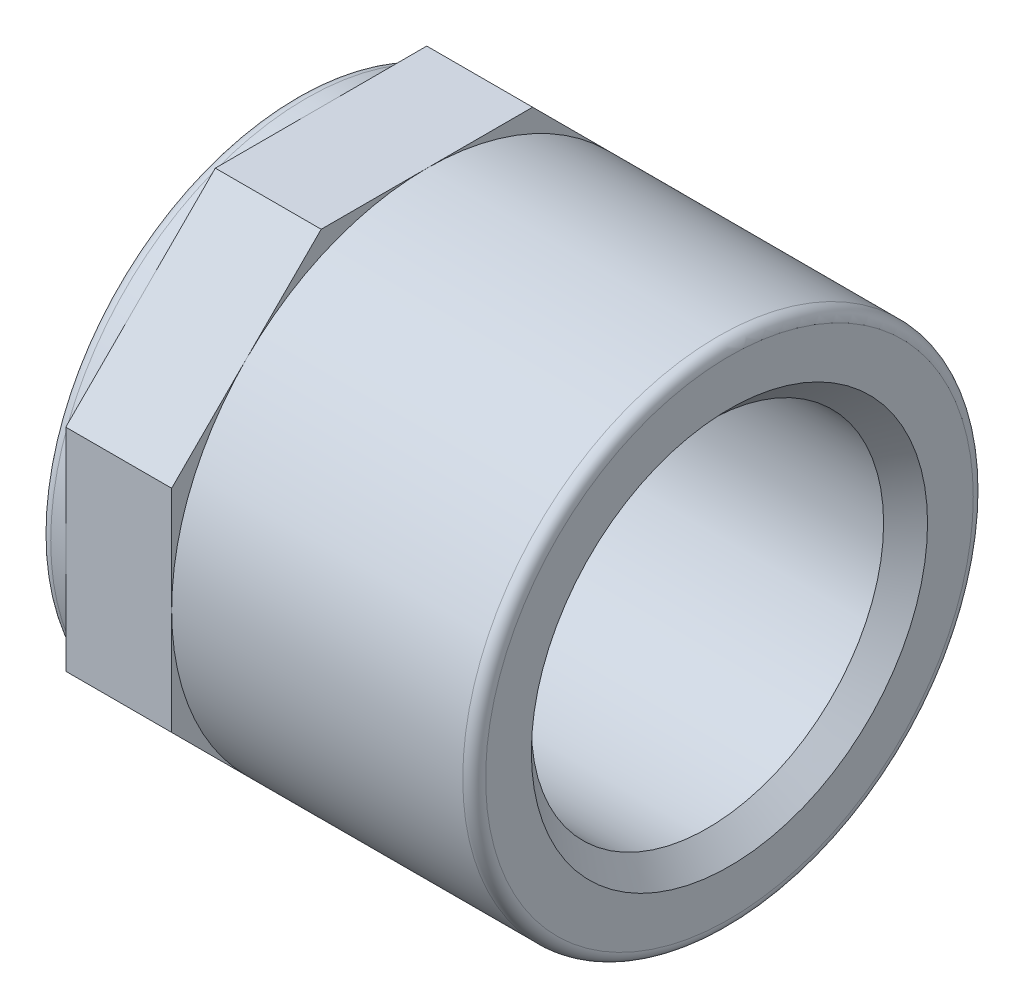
from build123d import *

# Parameters (mm, degrees)
BOSS_EXTRUDE1_DEPTH       = 5.6
SKETCH2_W                 = 1.4
SKETCH2_H                 = 13.5
SKETCH3_W                 = 16
SKETCH3_H                 = 13.5
M16_CLEARANCE_HOLE1_D     = 18.631
M16_CLEARANCE_HOLE1_DEPTH = 16
CHAMFER1_SIZE             = 1.162
FILLET1_R                 = 0.6045


with BuildPart() as part:
    # Sketch1 → Boss-Extrude1 (new body)
    with BuildSketch(Plane(origin=(-5.6, 0, 0), x_dir=(0, -1, 0), z_dir=(-1, 0, 0))):
        Polygon((-13.5, -5.591883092), (-5.591883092, -13.5), (5.591883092, -13.5), (13.5, -5.591883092), (13.5, 5.591883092), (5.591883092, 13.5), (-5.591883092, 13.5), (-13.5, 5.591883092), align=None)
    extrude(amount=-BOSS_EXTRUDE1_DEPTH)

    # Sketch2 → Revolve1 (revolve)
    with BuildSketch(Plane(origin=(0, 0, 0), x_dir=(-1, 0, 0), z_dir=(0, 0, -1)), mode=Mode.PRIVATE) as revolve1_sk:
        with Locations((6.3, 6.75)):
            Rectangle(SKETCH2_W, SKETCH2_H)
    revolve(revolve1_sk.sketch.rotate(Axis((-5.6, 0, 0), (-1, 0, 0)), 270), axis=Axis((-5.6, 0, 0), (-1, 0, 0)))

    # Sketch3 → Revolve2 (revolve)
    with BuildSketch(Plane.XY, mode=Mode.PRIVATE) as revolve2_sk:
        with Locations((8, 6.75)):
            Rectangle(SKETCH3_W, SKETCH3_H)
    revolve(revolve2_sk.sketch.rotate(Axis((0, 0, 0), (1, 0, 0)), 270), axis=Axis((0, 0, 0), (1, 0, 0)))

    # M16 Clearance Hole1
    with Locations(Plane(origin=(16, 0, 0), x_dir=(0, 0, -1), z_dir=(1, 0, 0))):
        with Locations((0, 0)):
            Hole(M16_CLEARANCE_HOLE1_D / 2, depth=M16_CLEARANCE_HOLE1_DEPTH)

    # Chamfer1
    chamfer1_edges = [part.edges().sort_by_distance(p)[0] for p in [
        (16, 0, -9.3155),
    ]]
    chamfer(chamfer1_edges, length=CHAMFER1_SIZE)

    # Fillet1
    fillet1_edges = [part.edges().sort_by_distance(p)[0] for p in [
        (-7, 0, -13.5),
        (16, 0, 13.5),
    ]]
    fillet(fillet1_edges, radius=FILLET1_R)


solid = part.part
